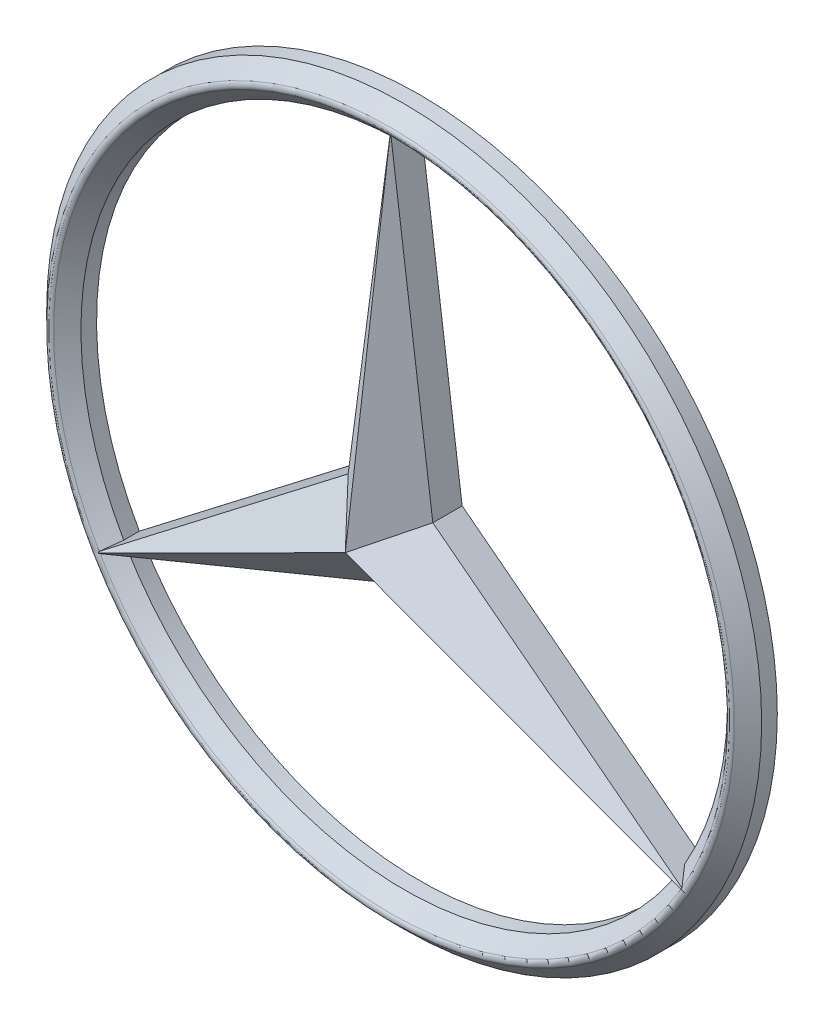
ISO-10303-21;
HEADER;
FILE_DESCRIPTION(('STEP AP214'),'2;1');
FILE_NAME('part.step','',(''),(''),'','','');
FILE_SCHEMA(('AUTOMOTIVE_DESIGN { 1 0 10303 214 1 1 1 1 }'));
ENDSEC;
DATA;
#1=APPLICATION_CONTEXT('core data for automotive mechanical design processes');
#2=APPLICATION_PROTOCOL_DEFINITION('international standard','automotive_design',2000,#1);
#3=PRODUCT_CONTEXT('',#1,'mechanical');
#4=PRODUCT('Part','Part','',(#3));
#5=PRODUCT_RELATED_PRODUCT_CATEGORY('part','',(#4));
#6=PRODUCT_DEFINITION_FORMATION('','',#4);
#7=PRODUCT_DEFINITION_CONTEXT('part definition',#1,'design');
#8=PRODUCT_DEFINITION('design','',#6,#7);
#9=PRODUCT_DEFINITION_SHAPE('','',#8);
#10=(LENGTH_UNIT() NAMED_UNIT(*) SI_UNIT(.MILLI.,.METRE.));
#11=(NAMED_UNIT(*) PLANE_ANGLE_UNIT() SI_UNIT($,.RADIAN.));
#12=(NAMED_UNIT(*) SI_UNIT($,.STERADIAN.) SOLID_ANGLE_UNIT());
#13=UNCERTAINTY_MEASURE_WITH_UNIT(LENGTH_MEASURE(1.E-05),#10,'distance_accuracy_value','');
#14=(GEOMETRIC_REPRESENTATION_CONTEXT(3) GLOBAL_UNCERTAINTY_ASSIGNED_CONTEXT((#13)) GLOBAL_UNIT_ASSIGNED_CONTEXT((#10,
#11,#12)) REPRESENTATION_CONTEXT('',''));
#15=CARTESIAN_POINT('',(0.,0.,0.));
#16=DIRECTION('',(0.,0.,1.));
#17=DIRECTION('',(1.,0.,0.));
#18=AXIS2_PLACEMENT_3D('',#15,#16,#17);
#19=CARTESIAN_POINT('',(0.,5.17159232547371,3.05312334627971));
#20=DIRECTION('',(0.,0.,1.));
#21=DIRECTION('',(0.,-1.,0.));
#22=AXIS2_PLACEMENT_3D('',#19,#20,#21);
#23=CONICAL_SURFACE('',#22,27.8472474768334,0.785398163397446);
#24=CARTESIAN_POINT('',(22.9461360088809,-7.97843726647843,1.65296334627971));
#25=CARTESIAN_POINT('',(23.0954369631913,-8.09336919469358,1.83964845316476));
#26=CARTESIAN_POINT('',(23.2447242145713,-8.20829057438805,2.0263510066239));
#27=CARTESIAN_POINT('',(23.5432713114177,-8.43811223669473,2.39979100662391));
#28=CARTESIAN_POINT('',(23.692531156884,-8.55301251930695,2.58652845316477));
#29=CARTESIAN_POINT('',(23.84177729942,-8.66790225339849,2.7732833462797));
#30=B_SPLINE_CURVE_WITH_KNOTS('',3,(#24,#25,#26,#27,#28,#29),.UNSPECIFIED.,.F.,.F.,(4,2,4),(0.,
0.795715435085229,1.59143086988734),.UNSPECIFIED.);
#31=CARTESIAN_POINT('',(22.9462639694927,-7.97853577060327,1.65312334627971));
#32=VERTEX_POINT('',#31);
#33=CARTESIAN_POINT('',(23.839377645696,-8.6660549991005,2.7702806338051));
#34=VERTEX_POINT('',#33);
#35=EDGE_CURVE('E232',#32,#34,#30,.T.);
#36=ORIENTED_EDGE('',*,*,#35,.T.);
#37=CARTESIAN_POINT('',(0.,5.17159232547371,2.7702806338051));
#38=DIRECTION('',(0.,0.,-1.));
#39=DIRECTION('',(0.,1.,0.));
#40=AXIS2_PLACEMENT_3D('',#37,#38,#39);
#41=CIRCLE('',#40,27.5644047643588);
#42=CARTESIAN_POINT('',(0.0376878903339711,32.7359713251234,2.77028063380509));
#43=VERTEX_POINT('',#42);
#44=EDGE_CURVE('E350',#34,#43,#41,.F.);
#45=ORIENTED_EDGE('',*,*,#44,.T.);
#46=CARTESIAN_POINT('',(0.0372877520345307,32.738974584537,2.7732833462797));
#47=CARTESIAN_POINT('',(0.0621745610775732,32.5521853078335,2.5865264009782));
#48=CARTESIAN_POINT('',(0.087063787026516,32.3653778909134,2.39978792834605));
#49=CARTESIAN_POINT('',(0.136847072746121,31.9917267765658,2.02634792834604));
#50=CARTESIAN_POINT('',(0.161741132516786,31.8048830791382,1.83964640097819));
#51=CARTESIAN_POINT('',(0.186637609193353,31.618021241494,1.65296334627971));
#52=B_SPLINE_CURVE_WITH_KNOTS('',3,(#46,#47,#48,#49,#50,#51),.UNSPECIFIED.,.F.,.F.,(4,2,4),(0.,
0.795920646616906,1.59184129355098),.UNSPECIFIED.);
#53=CARTESIAN_POINT('',(0.186616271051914,31.6181813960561,1.6531233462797));
#54=VERTEX_POINT('',#53);
#55=EDGE_CURVE('E283',#43,#54,#52,.T.);
#56=ORIENTED_EDGE('',*,*,#55,.T.);
#57=CARTESIAN_POINT('',(0.,5.17159232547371,1.6531233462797));
#58=DIRECTION('',(0.,0.,1.));
#59=DIRECTION('',(0.,-1.,0.));
#60=AXIS2_PLACEMENT_3D('',#57,#58,#59);
#61=CIRCLE('',#60,26.4472474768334);
#62=EDGE_CURVE('E211',#32,#54,#61,.T.);
#63=ORIENTED_EDGE('',*,*,#62,.F.);
#64=EDGE_LOOP('',(#36,#45,#56,#63));
#65=FACE_BOUND('',#64,.T.);
#66=ADVANCED_FACE('F37',(#65),#23,.F.);
#67=CARTESIAN_POINT('',(-0.186637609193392,31.618021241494,1.65296334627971));
#68=CARTESIAN_POINT('',(-0.161741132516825,31.8048830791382,1.83964640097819));
#69=CARTESIAN_POINT('',(-0.13684707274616,31.9917267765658,2.02634792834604));
#70=CARTESIAN_POINT('',(-0.0870637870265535,32.3653778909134,2.39978792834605));
#71=CARTESIAN_POINT('',(-0.0621745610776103,32.5521853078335,2.5865264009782));
#72=CARTESIAN_POINT('',(-0.0372877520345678,32.738974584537,2.7732833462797));
#73=B_SPLINE_CURVE_WITH_KNOTS('',3,(#67,#68,#69,#70,#71,#72),.UNSPECIFIED.,.F.,.F.,(4,2,4),(0.,
0.795920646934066,1.59184129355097),.UNSPECIFIED.);
#74=CARTESIAN_POINT('',(-0.186616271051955,31.6181813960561,1.6531233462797));
#75=VERTEX_POINT('',#74);
#76=CARTESIAN_POINT('',(-0.0376878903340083,32.7359713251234,2.77028063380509));
#77=VERTEX_POINT('',#76);
#78=EDGE_CURVE('E277',#75,#77,#73,.T.);
#79=ORIENTED_EDGE('',*,*,#78,.T.);
#80=CARTESIAN_POINT('',(0.,5.17159232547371,2.7702806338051));
#81=DIRECTION('',(0.,0.,-1.));
#82=DIRECTION('',(0.,1.,0.));
#83=AXIS2_PLACEMENT_3D('',#80,#81,#82);
#84=CIRCLE('',#83,27.5644047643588);
#85=CARTESIAN_POINT('',(-23.839377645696,-8.66605499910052,2.7702806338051));
#86=VERTEX_POINT('',#85);
#87=EDGE_CURVE('E353',#77,#86,#84,.F.);
#88=ORIENTED_EDGE('',*,*,#87,.T.);
#89=CARTESIAN_POINT('',(-23.84177729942,-8.6679022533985,2.7732833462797));
#90=CARTESIAN_POINT('',(-23.692531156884,-8.55301251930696,2.58652845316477));
#91=CARTESIAN_POINT('',(-23.5432713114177,-8.43811223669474,2.39979100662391));
#92=CARTESIAN_POINT('',(-23.2447242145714,-8.20829057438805,2.0263510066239));
#93=CARTESIAN_POINT('',(-23.0954369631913,-8.09336919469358,1.83964845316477));
#94=CARTESIAN_POINT('',(-22.9461360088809,-7.97843726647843,1.65296334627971));
#95=B_SPLINE_CURVE_WITH_KNOTS('',3,(#89,#90,#91,#92,#93,#94),.UNSPECIFIED.,.F.,.F.,(4,2,4),(0.,
0.795715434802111,1.59143086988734),.UNSPECIFIED.);
#96=CARTESIAN_POINT('',(-22.9462639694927,-7.97853577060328,1.65312334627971));
#97=VERTEX_POINT('',#96);
#98=EDGE_CURVE('E266',#86,#97,#95,.T.);
#99=ORIENTED_EDGE('',*,*,#98,.T.);
#100=EDGE_CURVE('E210',#75,#97,#61,.T.);
#101=ORIENTED_EDGE('',*,*,#100,.F.);
#102=EDGE_LOOP('',(#79,#88,#99,#101));
#103=FACE_BOUND('',#102,.T.);
#104=ADVANCED_FACE('F254',(#103),#23,.F.);
#105=CARTESIAN_POINT('',(-22.7270109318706,-8.35362154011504,1.65296334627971));
#106=CARTESIAN_POINT('',(-22.9014372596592,-8.42555374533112,1.83964298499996));
#107=CARTESIAN_POINT('',(-23.0758451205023,-8.49747833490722,2.02634280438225));
#108=CARTESIAN_POINT('',(-23.4246239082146,-8.64131228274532,2.39978280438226));
#109=CARTESIAN_POINT('',(-23.5989948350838,-8.71322164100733,2.58652298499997));
#110=CARTESIAN_POINT('',(-23.7733472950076,-8.78512338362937,2.7732833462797));
#111=B_SPLINE_CURVE_WITH_KNOTS('',3,(#105,#106,#107,#108,#109,#110),.UNSPECIFIED.,.F.,.F.,(4,2,
4),(0.,0.796261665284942,1.59252333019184),.UNSPECIFIED.);
#112=CARTESIAN_POINT('',(-22.7271604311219,-8.3536831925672,1.65312334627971));
#113=VERTEX_POINT('',#112);
#114=CARTESIAN_POINT('',(-23.7705440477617,-8.78396734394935,2.7702806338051));
#115=VERTEX_POINT('',#114);
#116=EDGE_CURVE('E272',#113,#115,#111,.T.);
#117=ORIENTED_EDGE('',*,*,#116,.T.);
#118=CARTESIAN_POINT('',(0.,5.17159232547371,2.7702806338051));
#119=DIRECTION('',(0.,0.,-1.));
#120=DIRECTION('',(0.,1.,0.));
#121=AXIS2_PLACEMENT_3D('',#118,#119,#120);
#122=CIRCLE('',#121,27.5644047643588);
#123=CARTESIAN_POINT('',(23.7705440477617,-8.78396734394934,2.7702806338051));
#124=VERTEX_POINT('',#123);
#125=EDGE_CURVE('E355',#115,#124,#122,.F.);
#126=ORIENTED_EDGE('',*,*,#125,.T.);
#127=CARTESIAN_POINT('',(23.7733472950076,-8.78512338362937,2.7732833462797));
#128=CARTESIAN_POINT('',(23.5989948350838,-8.71322164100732,2.58652298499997));
#129=CARTESIAN_POINT('',(23.4246239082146,-8.64131228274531,2.39978280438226));
#130=CARTESIAN_POINT('',(23.0758451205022,-8.49747833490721,2.02634280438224));
#131=CARTESIAN_POINT('',(22.9014372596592,-8.42555374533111,1.83964298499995));
#132=CARTESIAN_POINT('',(22.7270109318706,-8.35362154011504,1.65296334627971));
#133=B_SPLINE_CURVE_WITH_KNOTS('',3,(#127,#128,#129,#130,#131,#132),.UNSPECIFIED.,.F.,.F.,(4,2,
4),(0.,0.796261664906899,1.59252333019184),.UNSPECIFIED.);
#134=CARTESIAN_POINT('',(22.7271604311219,-8.35368319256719,1.65312334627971));
#135=VERTEX_POINT('',#134);
#136=EDGE_CURVE('E239',#124,#135,#133,.T.);
#137=ORIENTED_EDGE('',*,*,#136,.T.);
#138=EDGE_CURVE('E205',#113,#135,#61,.T.);
#139=ORIENTED_EDGE('',*,*,#138,.F.);
#140=EDGE_LOOP('',(#117,#126,#137,#139));
#141=FACE_BOUND('',#140,.T.);
#142=ADVANCED_FACE('F248',(#141),#23,.F.);
#143=CARTESIAN_POINT('',(0.,1.01883980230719,2.7731233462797));
#144=DIRECTION('',(-0.381246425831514,0.924473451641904,0.));
#145=DIRECTION('',(-0.924473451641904,-0.381246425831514,0.));
#146=AXIS2_PLACEMENT_3D('',#143,#144,#145);
#147=PLANE('',#146);
#148=DIRECTION('',(0.,0.,1.));
#149=VECTOR('',#148,1.);
#150=CARTESIAN_POINT('',(-22.7271604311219,-8.3536831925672,6.18858584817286));
#151=LINE('',#150,#149);
#152=CARTESIAN_POINT('',(-22.7271604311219,-8.3536831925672,0.373123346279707));
#153=VERTEX_POINT('',#152);
#154=EDGE_CURVE('E230',#153,#113,#151,.T.);
#155=ORIENTED_EDGE('',*,*,#154,.F.);
#156=DIRECTION('',(0.924473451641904,0.381246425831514,0.));
#157=VECTOR('',#156,1.);
#158=CARTESIAN_POINT('',(0.,1.01883980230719,0.373123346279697));
#159=LINE('',#158,#157);
#160=CARTESIAN_POINT('',(0.,1.01883980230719,0.373123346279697));
#161=VERTEX_POINT('',#160);
#162=EDGE_CURVE('E380',#153,#161,#159,.T.);
#163=ORIENTED_EDGE('',*,*,#162,.T.);
#164=DIRECTION('',(0.,0.,-1.));
#165=VECTOR('',#164,1.);
#166=CARTESIAN_POINT('',(0.,1.01883980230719,2.7731233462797));
#167=LINE('',#166,#165);
#168=CARTESIAN_POINT('',(0.,1.01883980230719,2.7731233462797));
#169=VERTEX_POINT('',#168);
#170=EDGE_CURVE('E357',#169,#161,#167,.T.);
#171=ORIENTED_EDGE('',*,*,#170,.F.);
#172=DIRECTION('',(0.924473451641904,0.381246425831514,0.));
#173=VECTOR('',#172,1.);
#174=CARTESIAN_POINT('',(0.,1.01883980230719,2.7731233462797));
#175=LINE('',#174,#173);
#176=CARTESIAN_POINT('',(-23.7732248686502,-8.78507289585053,2.7731233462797));
#177=VERTEX_POINT('',#176);
#178=EDGE_CURVE('E167',#177,#169,#175,.T.);
#179=ORIENTED_EDGE('',*,*,#178,.F.);
#180=CARTESIAN_POINT('',(-23.7732248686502,-8.78507289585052,2.7731233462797));
#181=CARTESIAN_POINT('',(-23.772775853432,-8.78488772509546,2.77265200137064));
#182=CARTESIAN_POINT('',(-23.7723279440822,-8.78470301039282,2.7721794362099));
#183=CARTESIAN_POINT('',(-23.7714343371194,-8.78433449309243,2.77123186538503));
#184=CARTESIAN_POINT('',(-23.7709886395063,-8.78415069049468,2.77075685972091));
#185=CARTESIAN_POINT('',(-23.7705440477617,-8.78396734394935,2.7702806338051));
#186=B_SPLINE_CURVE_WITH_KNOTS('',3,(#180,#181,#182,#183,#184,#185),.UNSPECIFIED.,.F.,.F.,(4,2,
4),(0.,0.00203040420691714,0.00406080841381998),.UNSPECIFIED.);
#187=EDGE_CURVE('E398',#177,#115,#186,.T.);
#188=ORIENTED_EDGE('',*,*,#187,.T.);
#189=ORIENTED_EDGE('',*,*,#116,.F.);
#190=EDGE_LOOP('',(#155,#163,#171,#179,#188,#189));
#191=FACE_BOUND('',#190,.T.);
#192=ADVANCED_FACE('F253',(#191),#147,.F.);
#193=CARTESIAN_POINT('',(24.2487113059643,-8.98116019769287,2.7731233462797));
#194=DIRECTION('',(0.381246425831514,0.924473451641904,0.));
#195=DIRECTION('',(-0.924473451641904,0.381246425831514,0.));
#196=AXIS2_PLACEMENT_3D('',#193,#194,#195);
#197=PLANE('',#196);
#198=DIRECTION('',(0.,0.,1.));
#199=VECTOR('',#198,1.);
#200=CARTESIAN_POINT('',(22.7271604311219,-8.35368319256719,6.18858584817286));
#201=LINE('',#200,#199);
#202=CARTESIAN_POINT('',(22.7271604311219,-8.35368319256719,0.373123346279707));
#203=VERTEX_POINT('',#202);
#204=EDGE_CURVE('E228',#135,#203,#201,.F.);
#205=ORIENTED_EDGE('',*,*,#204,.F.);
#206=ORIENTED_EDGE('',*,*,#136,.F.);
#207=CARTESIAN_POINT('',(23.7705440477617,-8.78396734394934,2.7702806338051));
#208=CARTESIAN_POINT('',(23.7709886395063,-8.78415069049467,2.77075685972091));
#209=CARTESIAN_POINT('',(23.7714343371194,-8.78433449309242,2.77123186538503));
#210=CARTESIAN_POINT('',(23.7723279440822,-8.78470301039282,2.7721794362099));
#211=CARTESIAN_POINT('',(23.772775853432,-8.78488772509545,2.77265200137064));
#212=CARTESIAN_POINT('',(23.7732248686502,-8.78507289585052,2.77312334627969));
#213=B_SPLINE_CURVE_WITH_KNOTS('',3,(#207,#208,#209,#210,#211,#212),.UNSPECIFIED.,.F.,.F.,(4,2,
4),(0.,0.0020304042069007,0.00406080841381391),.UNSPECIFIED.);
#214=CARTESIAN_POINT('',(23.7732248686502,-8.78507289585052,2.7731233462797));
#215=VERTEX_POINT('',#214);
#216=EDGE_CURVE('E393',#124,#215,#213,.T.);
#217=ORIENTED_EDGE('',*,*,#216,.T.);
#218=DIRECTION('',(0.924473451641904,-0.381246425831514,0.));
#219=VECTOR('',#218,1.);
#220=CARTESIAN_POINT('',(24.2487113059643,-8.98116019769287,2.7731233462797));
#221=LINE('',#220,#219);
#222=EDGE_CURVE('E387',#169,#215,#221,.T.);
#223=ORIENTED_EDGE('',*,*,#222,.F.);
#224=ORIENTED_EDGE('',*,*,#170,.T.);
#225=DIRECTION('',(0.924473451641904,-0.381246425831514,0.));
#226=VECTOR('',#225,1.);
#227=CARTESIAN_POINT('',(24.2487113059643,-8.98116019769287,0.373123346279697));
#228=LINE('',#227,#226);
#229=EDGE_CURVE('E377',#161,#203,#228,.T.);
#230=ORIENTED_EDGE('',*,*,#229,.T.);
#231=EDGE_LOOP('',(#205,#206,#217,#223,#224,#230));
#232=FACE_BOUND('',#231,.T.);
#233=ADVANCED_FACE('F395',(#232),#197,.F.);
#234=CARTESIAN_POINT('',(3.46410161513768,7.01883980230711,2.7731233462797));
#235=DIRECTION('',(-0.609994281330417,-0.792405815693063,0.));
#236=DIRECTION('',(0.792405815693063,-0.609994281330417,0.));
#237=AXIS2_PLACEMENT_3D('',#234,#235,#236);
#238=PLANE('',#237);
#239=DIRECTION('',(0.,0.,1.));
#240=VECTOR('',#239,1.);
#241=CARTESIAN_POINT('',(22.9462639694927,-7.97853577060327,6.18858584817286));
#242=LINE('',#241,#240);
#243=CARTESIAN_POINT('',(22.9462639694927,-7.97853577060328,0.373123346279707));
#244=VERTEX_POINT('',#243);
#245=EDGE_CURVE('E226',#244,#32,#242,.T.);
#246=ORIENTED_EDGE('',*,*,#245,.F.);
#247=DIRECTION('',(-0.792405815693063,0.609994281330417,0.));
#248=VECTOR('',#247,1.);
#249=CARTESIAN_POINT('',(3.46410161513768,7.01883980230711,0.373123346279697));
#250=LINE('',#249,#248);
#251=CARTESIAN_POINT('',(3.46410161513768,7.01883980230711,0.373123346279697));
#252=VERTEX_POINT('',#251);
#253=EDGE_CURVE('E375',#244,#252,#250,.T.);
#254=ORIENTED_EDGE('',*,*,#253,.T.);
#255=DIRECTION('',(0.,0.,-1.));
#256=VECTOR('',#255,1.);
#257=CARTESIAN_POINT('',(3.46410161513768,7.01883980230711,2.7731233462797));
#258=LINE('',#257,#256);
#259=CARTESIAN_POINT('',(3.46410161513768,7.01883980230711,2.7731233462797));
#260=VERTEX_POINT('',#259);
#261=EDGE_CURVE('E360',#260,#252,#258,.T.);
#262=ORIENTED_EDGE('',*,*,#261,.F.);
#263=DIRECTION('',(-0.792405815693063,0.609994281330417,0.));
#264=VECTOR('',#263,1.);
#265=CARTESIAN_POINT('',(3.46410161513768,7.01883980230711,2.7731233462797));
#266=LINE('',#265,#264);
#267=CARTESIAN_POINT('',(23.8416724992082,-8.66782157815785,2.7731233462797));
#268=VERTEX_POINT('',#267);
#269=EDGE_CURVE('E56',#268,#260,#266,.T.);
#270=ORIENTED_EDGE('',*,*,#269,.F.);
#271=CARTESIAN_POINT('',(23.8416724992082,-8.66782157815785,2.7731233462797));
#272=CARTESIAN_POINT('',(23.8412881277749,-8.66752568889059,2.77265199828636));
#273=CARTESIAN_POINT('',(23.8409047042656,-8.66723052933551,2.77217943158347));
#274=CARTESIAN_POINT('',(23.8401397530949,-8.66664166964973,2.77123186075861));
#275=CARTESIAN_POINT('',(23.8397582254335,-8.66634796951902,2.77075685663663));
#276=CARTESIAN_POINT('',(23.839377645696,-8.6660549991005,2.7702806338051));
#277=B_SPLINE_CURVE_WITH_KNOTS('',3,(#271,#272,#273,#274,#275,#276),.UNSPECIFIED.,.F.,.F.,(4,2,
4),(0.,0.00202905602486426,0.00405811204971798),.UNSPECIFIED.);
#278=EDGE_CURVE('E11',#268,#34,#277,.T.);
#279=ORIENTED_EDGE('',*,*,#278,.T.);
#280=ORIENTED_EDGE('',*,*,#35,.F.);
#281=EDGE_LOOP('',(#246,#254,#262,#270,#279,#280));
#282=FACE_BOUND('',#281,.T.);
#283=ADVANCED_FACE('F245',(#282),#238,.F.);
#284=CARTESIAN_POINT('',(0.,33.0188398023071,2.7731233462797));
#285=DIRECTION('',(-0.99124070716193,-0.132067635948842,0.));
#286=DIRECTION('',(0.132067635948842,-0.991240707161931,0.));
#287=AXIS2_PLACEMENT_3D('',#284,#285,#286);
#288=PLANE('',#287);
#289=DIRECTION('',(0.,0.,1.));
#290=VECTOR('',#289,1.);
#291=CARTESIAN_POINT('',(0.186616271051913,31.6181813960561,6.18858584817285));
#292=LINE('',#291,#290);
#293=CARTESIAN_POINT('',(0.186616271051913,31.6181813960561,0.373123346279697));
#294=VERTEX_POINT('',#293);
#295=EDGE_CURVE('E224',#54,#294,#292,.F.);
#296=ORIENTED_EDGE('',*,*,#295,.F.);
#297=ORIENTED_EDGE('',*,*,#55,.F.);
#298=CARTESIAN_POINT('',(0.0376878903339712,32.7359713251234,2.77028063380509));
#299=CARTESIAN_POINT('',(0.0376244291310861,32.7364476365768,2.77075685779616));
#300=CARTESIAN_POINT('',(0.0375608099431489,32.7369251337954,2.77123186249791));
#301=CARTESIAN_POINT('',(0.0374332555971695,32.7378824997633,2.77217943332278));
#302=CARTESIAN_POINT('',(0.0373693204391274,32.7383623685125,2.7726519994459));
#303=CARTESIAN_POINT('',(0.0373052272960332,32.7388434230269,2.7731233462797));
#304=B_SPLINE_CURVE_WITH_KNOTS('',3,(#298,#299,#300,#301,#302,#303),.UNSPECIFIED.,.F.,.F.,(4,2,
4),(0.,0.00202956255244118,0.0040591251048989),.UNSPECIFIED.);
#305=CARTESIAN_POINT('',(0.0373052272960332,32.7388434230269,2.7731233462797));
#306=VERTEX_POINT('',#305);
#307=EDGE_CURVE('E341',#43,#306,#304,.T.);
#308=ORIENTED_EDGE('',*,*,#307,.T.);
#309=DIRECTION('',(-0.132067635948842,0.991240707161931,0.));
#310=VECTOR('',#309,1.);
#311=CARTESIAN_POINT('',(0.,33.0188398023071,2.7731233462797));
#312=LINE('',#311,#310);
#313=EDGE_CURVE('E384',#260,#306,#312,.T.);
#314=ORIENTED_EDGE('',*,*,#313,.F.);
#315=ORIENTED_EDGE('',*,*,#261,.T.);
#316=DIRECTION('',(-0.132067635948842,0.991240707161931,0.));
#317=VECTOR('',#316,1.);
#318=CARTESIAN_POINT('',(0.,33.0188398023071,0.373123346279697));
#319=LINE('',#318,#317);
#320=EDGE_CURVE('E372',#252,#294,#319,.T.);
#321=ORIENTED_EDGE('',*,*,#320,.T.);
#322=EDGE_LOOP('',(#296,#297,#308,#314,#315,#321));
#323=FACE_BOUND('',#322,.T.);
#324=ADVANCED_FACE('F292',(#323),#288,.F.);
#325=CARTESIAN_POINT('',(-3.46410161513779,7.01883980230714,2.7731233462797));
#326=DIRECTION('',(0.99124070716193,-0.132067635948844,0.));
#327=DIRECTION('',(0.132067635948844,0.99124070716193,0.));
#328=AXIS2_PLACEMENT_3D('',#325,#326,#327);
#329=PLANE('',#328);
#330=DIRECTION('',(0.,0.,1.));
#331=VECTOR('',#330,1.);
#332=CARTESIAN_POINT('',(-0.186616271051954,31.6181813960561,6.18858584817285));
#333=LINE('',#332,#331);
#334=CARTESIAN_POINT('',(-0.186616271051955,31.6181813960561,0.373123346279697));
#335=VERTEX_POINT('',#334);
#336=EDGE_CURVE('E222',#335,#75,#333,.T.);
#337=ORIENTED_EDGE('',*,*,#336,.F.);
#338=DIRECTION('',(-0.132067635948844,-0.99124070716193,0.));
#339=VECTOR('',#338,1.);
#340=CARTESIAN_POINT('',(-3.46410161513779,7.01883980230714,0.373123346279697));
#341=LINE('',#340,#339);
#342=CARTESIAN_POINT('',(-3.46410161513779,7.01883980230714,0.373123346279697));
#343=VERTEX_POINT('',#342);
#344=EDGE_CURVE('E370',#335,#343,#341,.T.);
#345=ORIENTED_EDGE('',*,*,#344,.T.);
#346=DIRECTION('',(0.,0.,-1.));
#347=VECTOR('',#346,1.);
#348=CARTESIAN_POINT('',(-3.46410161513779,7.01883980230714,2.7731233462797));
#349=LINE('',#348,#347);
#350=CARTESIAN_POINT('',(-3.46410161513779,7.01883980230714,2.7731233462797));
#351=VERTEX_POINT('',#350);
#352=EDGE_CURVE('E363',#351,#343,#349,.T.);
#353=ORIENTED_EDGE('',*,*,#352,.F.);
#354=DIRECTION('',(-0.132067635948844,-0.99124070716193,0.));
#355=VECTOR('',#354,1.);
#356=CARTESIAN_POINT('',(-3.46410161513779,7.01883980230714,2.7731233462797));
#357=LINE('',#356,#355);
#358=CARTESIAN_POINT('',(-0.0373052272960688,32.7388434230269,2.7731233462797));
#359=VERTEX_POINT('',#358);
#360=EDGE_CURVE('E195',#359,#351,#357,.T.);
#361=ORIENTED_EDGE('',*,*,#360,.F.);
#362=CARTESIAN_POINT('',(-0.0373052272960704,32.7388434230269,2.7731233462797));
#363=CARTESIAN_POINT('',(-0.0373693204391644,32.7383623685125,2.7726519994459));
#364=CARTESIAN_POINT('',(-0.0374332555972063,32.7378824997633,2.77217943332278));
#365=CARTESIAN_POINT('',(-0.037560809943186,32.7369251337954,2.77123186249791));
#366=CARTESIAN_POINT('',(-0.0376244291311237,32.7364476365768,2.77075685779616));
#367=CARTESIAN_POINT('',(-0.0376878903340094,32.7359713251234,2.77028063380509));
#368=B_SPLINE_CURVE_WITH_KNOTS('',3,(#362,#363,#364,#365,#366,#367),.UNSPECIFIED.,.F.,.F.,(4,2,
4),(0.,0.00202956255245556,0.00405912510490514),.UNSPECIFIED.);
#369=EDGE_CURVE('E299',#359,#77,#368,.T.);
#370=ORIENTED_EDGE('',*,*,#369,.T.);
#371=ORIENTED_EDGE('',*,*,#78,.F.);
#372=EDGE_LOOP('',(#337,#345,#353,#361,#370,#371));
#373=FACE_BOUND('',#372,.T.);
#374=ADVANCED_FACE('F288',(#373),#329,.F.);
#375=CARTESIAN_POINT('',(-24.2487113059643,-8.98116019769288,2.7731233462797));
#376=DIRECTION('',(0.60999428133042,-0.792405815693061,0.));
#377=DIRECTION('',(0.792405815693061,0.60999428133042,0.));
#378=AXIS2_PLACEMENT_3D('',#375,#376,#377);
#379=PLANE('',#378);
#380=DIRECTION('',(0.,0.,1.));
#381=VECTOR('',#380,1.);
#382=CARTESIAN_POINT('',(-22.9462639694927,-7.97853577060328,6.18858584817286));
#383=LINE('',#382,#381);
#384=CARTESIAN_POINT('',(-22.9462639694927,-7.97853577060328,0.373123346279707));
#385=VERTEX_POINT('',#384);
#386=EDGE_CURVE('E220',#97,#385,#383,.F.);
#387=ORIENTED_EDGE('',*,*,#386,.F.);
#388=ORIENTED_EDGE('',*,*,#98,.F.);
#389=CARTESIAN_POINT('',(-23.839377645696,-8.66605499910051,2.7702806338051));
#390=CARTESIAN_POINT('',(-23.8397582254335,-8.66634796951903,2.77075685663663));
#391=CARTESIAN_POINT('',(-23.8401397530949,-8.66664166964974,2.77123186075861));
#392=CARTESIAN_POINT('',(-23.8409047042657,-8.66723052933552,2.77217943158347));
#393=CARTESIAN_POINT('',(-23.8412881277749,-8.6675256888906,2.77265199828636));
#394=CARTESIAN_POINT('',(-23.8416724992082,-8.66782157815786,2.7731233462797));
#395=B_SPLINE_CURVE_WITH_KNOTS('',3,(#389,#390,#391,#392,#393,#394),.UNSPECIFIED.,.F.,.F.,(4,2,
4),(0.,0.00202905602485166,0.00405811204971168),.UNSPECIFIED.);
#396=CARTESIAN_POINT('',(-23.8416724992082,-8.66782157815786,2.7731233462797));
#397=VERTEX_POINT('',#396);
#398=EDGE_CURVE('E305',#86,#397,#395,.T.);
#399=ORIENTED_EDGE('',*,*,#398,.T.);
#400=DIRECTION('',(-0.792405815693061,-0.60999428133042,0.));
#401=VECTOR('',#400,1.);
#402=CARTESIAN_POINT('',(-24.2487113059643,-8.98116019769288,2.7731233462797));
#403=LINE('',#402,#401);
#404=EDGE_CURVE('E366',#351,#397,#403,.T.);
#405=ORIENTED_EDGE('',*,*,#404,.F.);
#406=ORIENTED_EDGE('',*,*,#352,.T.);
#407=DIRECTION('',(-0.792405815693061,-0.60999428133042,0.));
#408=VECTOR('',#407,1.);
#409=CARTESIAN_POINT('',(-24.2487113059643,-8.98116019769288,0.373123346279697));
#410=LINE('',#409,#408);
#411=EDGE_CURVE('E367',#343,#385,#410,.T.);
#412=ORIENTED_EDGE('',*,*,#411,.T.);
#413=EDGE_LOOP('',(#387,#388,#399,#405,#406,#412));
#414=FACE_BOUND('',#413,.T.);
#415=ADVANCED_FACE('F291',(#414),#379,.F.);
#416=CARTESIAN_POINT('',(0.,1.01883980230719,0.373123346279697));
#417=DIRECTION('',(0.,0.,1.));
#418=DIRECTION('',(1.,0.,0.));
#419=AXIS2_PLACEMENT_3D('',#416,#417,#418);
#420=PLANE('',#419);
#421=ORIENTED_EDGE('',*,*,#162,.F.);
#422=CARTESIAN_POINT('',(0.,5.17159232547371,0.373123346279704));
#423=DIRECTION('',(0.,0.,1.));
#424=DIRECTION('',(0.,-1.,0.));
#425=AXIS2_PLACEMENT_3D('',#422,#423,#424);
#426=CIRCLE('',#425,26.4472474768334);
#427=EDGE_CURVE('E212',#153,#203,#426,.T.);
#428=ORIENTED_EDGE('',*,*,#427,.T.);
#429=ORIENTED_EDGE('',*,*,#229,.F.);
#430=EDGE_LOOP('',(#421,#428,#429));
#431=FACE_BOUND('',#430,.T.);
#432=ORIENTED_EDGE('',*,*,#253,.F.);
#433=EDGE_CURVE('E216',#244,#294,#426,.T.);
#434=ORIENTED_EDGE('',*,*,#433,.T.);
#435=ORIENTED_EDGE('',*,*,#320,.F.);
#436=EDGE_LOOP('',(#432,#434,#435));
#437=FACE_BOUND('',#436,.T.);
#438=ORIENTED_EDGE('',*,*,#344,.F.);
#439=EDGE_CURVE('E215',#335,#385,#426,.T.);
#440=ORIENTED_EDGE('',*,*,#439,.T.);
#441=ORIENTED_EDGE('',*,*,#411,.F.);
#442=EDGE_LOOP('',(#438,#440,#441));
#443=FACE_BOUND('',#442,.T.);
#444=CARTESIAN_POINT('',(0.,5.17159232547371,0.373123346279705));
#445=DIRECTION('',(0.,0.,1.));
#446=DIRECTION('',(0.,-1.,0.));
#447=AXIS2_PLACEMENT_3D('',#444,#445,#446);
#448=CIRCLE('',#447,29.2472474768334);
#449=CARTESIAN_POINT('',(0.,-24.0756551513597,0.373123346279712));
#450=VERTEX_POINT('',#449);
#451=EDGE_CURVE('E217',#450,#450,#448,.T.);
#452=ORIENTED_EDGE('',*,*,#451,.F.);
#453=EDGE_LOOP('',(#452));
#454=FACE_BOUND('',#453,.T.);
#455=ADVANCED_FACE('F450',(#431,#437,#443,#454),#420,.F.);
#456=CARTESIAN_POINT('',(0.,5.17159232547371,6.18858584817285));
#457=DIRECTION('',(0.,0.,1.));
#458=DIRECTION('',(0.,-1.,0.));
#459=AXIS2_PLACEMENT_3D('',#456,#457,#458);
#460=CYLINDRICAL_SURFACE('',#459,26.4472474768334);
#461=ORIENTED_EDGE('',*,*,#427,.F.);
#462=ORIENTED_EDGE('',*,*,#154,.T.);
#463=ORIENTED_EDGE('',*,*,#138,.T.);
#464=ORIENTED_EDGE('',*,*,#204,.T.);
#465=EDGE_LOOP('',(#461,#462,#463,#464));
#466=FACE_BOUND('',#465,.T.);
#467=ADVANCED_FACE('F258',(#466),#460,.F.);
#468=ORIENTED_EDGE('',*,*,#433,.F.);
#469=ORIENTED_EDGE('',*,*,#245,.T.);
#470=ORIENTED_EDGE('',*,*,#62,.T.);
#471=ORIENTED_EDGE('',*,*,#295,.T.);
#472=EDGE_LOOP('',(#468,#469,#470,#471));
#473=FACE_BOUND('',#472,.T.);
#474=ADVANCED_FACE('F433',(#473),#460,.F.);
#475=ORIENTED_EDGE('',*,*,#439,.F.);
#476=ORIENTED_EDGE('',*,*,#336,.T.);
#477=ORIENTED_EDGE('',*,*,#100,.T.);
#478=ORIENTED_EDGE('',*,*,#386,.T.);
#479=EDGE_LOOP('',(#475,#476,#477,#478));
#480=FACE_BOUND('',#479,.T.);
#481=ADVANCED_FACE('F439',(#480),#460,.F.);
#482=CARTESIAN_POINT('',(0.,5.17159232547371,6.18858584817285));
#483=DIRECTION('',(0.,0.,1.));
#484=DIRECTION('',(0.,-1.,0.));
#485=AXIS2_PLACEMENT_3D('',#482,#483,#484);
#486=CYLINDRICAL_SURFACE('',#485,29.2472474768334);
#487=CARTESIAN_POINT('',(0.,5.17159232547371,1.65312334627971));
#488=DIRECTION('',(0.,0.,1.));
#489=DIRECTION('',(0.,-1.,0.));
#490=AXIS2_PLACEMENT_3D('',#487,#488,#489);
#491=CIRCLE('',#490,29.2472474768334);
#492=CARTESIAN_POINT('',(0.,-24.0756551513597,1.65312334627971));
#493=VERTEX_POINT('',#492);
#494=EDGE_CURVE('E202',#493,#493,#491,.T.);
#495=ORIENTED_EDGE('',*,*,#494,.F.);
#496=EDGE_LOOP('',(#495));
#497=FACE_BOUND('',#496,.T.);
#498=ORIENTED_EDGE('',*,*,#451,.T.);
#499=EDGE_LOOP('',(#498));
#500=FACE_BOUND('',#499,.T.);
#501=ADVANCED_FACE('F488',(#497,#500),#486,.T.);
#502=CARTESIAN_POINT('',(0.,5.17159232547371,1.65312334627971));
#503=DIRECTION('',(0.,0.,-1.));
#504=DIRECTION('',(0.,1.,0.));
#505=AXIS2_PLACEMENT_3D('',#502,#503,#504);
#506=CONICAL_SURFACE('',#505,29.2472474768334,0.785398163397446);
#507=CARTESIAN_POINT('',(0.,5.17159232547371,2.7702806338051));
#508=DIRECTION('',(0.,0.,1.));
#509=DIRECTION('',(0.,-1.,0.));
#510=AXIS2_PLACEMENT_3D('',#507,#508,#509);
#511=CIRCLE('',#510,28.130090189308);
#512=CARTESIAN_POINT('',(0.,-22.9584978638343,2.7702806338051));
#513=VERTEX_POINT('',#512);
#514=EDGE_CURVE('E347',#513,#513,#511,.F.);
#515=ORIENTED_EDGE('',*,*,#514,.T.);
#516=EDGE_LOOP('',(#515));
#517=FACE_BOUND('',#516,.T.);
#518=ORIENTED_EDGE('',*,*,#494,.T.);
#519=EDGE_LOOP('',(#518));
#520=FACE_BOUND('',#519,.T.);
#521=ADVANCED_FACE('F256',(#517,#520),#506,.T.);
#522=CARTESIAN_POINT('',(-3.46410161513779,7.01883980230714,2.7731233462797));
#523=DIRECTION('',(-0.431331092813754,0.56031552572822,0.707106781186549));
#524=DIRECTION('',(0.,-0.783763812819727,0.621059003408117));
#525=AXIS2_PLACEMENT_3D('',#522,#523,#524);
#526=PLANE('',#525);
#527=ORIENTED_EDGE('',*,*,#404,.T.);
#528=CARTESIAN_POINT('',(-23.8416724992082,-8.66782157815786,2.7731233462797));
#529=CARTESIAN_POINT('',(-23.8433091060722,-8.67576029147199,2.77841570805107));
#530=CARTESIAN_POINT('',(-23.8451556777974,-8.68372775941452,2.78360277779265));
#531=CARTESIAN_POINT('',(-23.8492827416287,-8.69967587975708,2.79372267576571));
#532=CARTESIAN_POINT('',(-23.8515619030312,-8.70765641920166,2.79865622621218));
#533=CARTESIAN_POINT('',(-23.8565780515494,-8.72363545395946,2.80825828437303));
#534=CARTESIAN_POINT('',(-23.8593150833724,-8.73163395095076,2.81292676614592));
#535=CARTESIAN_POINT('',(-23.8652767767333,-8.74764584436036,2.82197808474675));
#536=CARTESIAN_POINT('',(-23.8685028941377,-8.75565921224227,2.82636001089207));
#537=CARTESIAN_POINT('',(-23.8719803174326,-8.76365446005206,2.83057428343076));
#538=B_SPLINE_CURVE_WITH_KNOTS('',3,(#528,#529,#530,#531,#532,#533,#534,#535,#536,#537),
.UNSPECIFIED.,.F.,.F.,(4,2,2,2,4),(0.,0.0290405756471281,0.0579932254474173,0.0869487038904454,
0.115992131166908),.UNSPECIFIED.);
#539=CARTESIAN_POINT('',(-23.8719803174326,-8.76365446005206,2.83057428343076));
#540=VERTEX_POINT('',#539);
#541=EDGE_CURVE('E200',#397,#540,#538,.T.);
#542=ORIENTED_EDGE('',*,*,#541,.T.);
#543=DIRECTION('',(-0.85857024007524,-0.495695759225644,-0.130930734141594));
#544=VECTOR('',#543,1.);
#545=CARTESIAN_POINT('',(-24.2487113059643,-8.98116019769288,2.7731233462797));
#546=LINE('',#545,#544);
#547=CARTESIAN_POINT('',(0.,5.01883980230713,6.47101715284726));
#548=VERTEX_POINT('',#547);
#549=EDGE_CURVE('E165',#548,#540,#546,.T.);
#550=ORIENTED_EDGE('',*,*,#549,.F.);
#551=DIRECTION('',(-0.635915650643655,0.367146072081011,-0.678833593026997));
#552=VECTOR('',#551,1.);
#553=CARTESIAN_POINT('',(-8.13358028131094,9.71476456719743,-2.21149839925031));
#554=LINE('',#553,#552);
#555=EDGE_CURVE('E190',#548,#351,#554,.T.);
#556=ORIENTED_EDGE('',*,*,#555,.T.);
#557=EDGE_LOOP('',(#527,#542,#550,#556));
#558=FACE_BOUND('',#557,.T.);
#559=ADVANCED_FACE('F198',(#558),#526,.T.);
#560=CARTESIAN_POINT('',(-24.2487113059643,-8.98116019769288,2.7731233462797));
#561=DIRECTION('',(0.269581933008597,-0.653701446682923,0.707106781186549));
#562=DIRECTION('',(0.,-0.734292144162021,-0.678833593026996));
#563=AXIS2_PLACEMENT_3D('',#560,#561,#562);
#564=PLANE('',#563);
#565=ORIENTED_EDGE('',*,*,#549,.T.);
#566=CARTESIAN_POINT('',(-23.8719803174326,-8.76365446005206,2.83057428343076));
#567=CARTESIAN_POINT('',(-23.8632719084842,-8.76462137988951,2.82636034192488));
#568=CARTESIAN_POINT('',(-23.8546722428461,-8.76581438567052,2.82197884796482));
#569=CARTESIAN_POINT('',(-23.8377283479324,-8.76861692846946,2.81292817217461));
#570=CARTESIAN_POINT('',(-23.8293834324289,-8.77022521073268,2.80825988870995));
#571=CARTESIAN_POINT('',(-23.8129356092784,-8.77382864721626,2.79865793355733));
#572=CARTESIAN_POINT('',(-23.8048326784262,-8.77582376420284,2.79372428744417));
#573=CARTESIAN_POINT('',(-23.7888513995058,-8.78018038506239,2.78360390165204));
#574=CARTESIAN_POINT('',(-23.7809737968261,-8.78254296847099,2.77841644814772));
#575=CARTESIAN_POINT('',(-23.7732248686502,-8.7850728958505,2.77312334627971));
#576=B_SPLINE_CURVE_WITH_KNOTS('',3,(#566,#567,#568,#569,#570,#571,#572,#573,#574,#575),
.UNSPECIFIED.,.F.,.F.,(4,2,2,2,4),(0.,0.0291597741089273,0.0582324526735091,0.0873023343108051,
0.116459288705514),.UNSPECIFIED.);
#577=EDGE_CURVE('E322',#540,#177,#576,.T.);
#578=ORIENTED_EDGE('',*,*,#577,.T.);
#579=ORIENTED_EDGE('',*,*,#178,.T.);
#580=DIRECTION('',(0.,-0.734292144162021,-0.678833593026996));
#581=VECTOR('',#580,1.);
#582=CARTESIAN_POINT('',(0.,-4.37300972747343,-2.21149839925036));
#583=LINE('',#582,#581);
#584=EDGE_CURVE('E161',#548,#169,#583,.T.);
#585=ORIENTED_EDGE('',*,*,#584,.F.);
#586=EDGE_LOOP('',(#565,#578,#579,#585));
#587=FACE_BOUND('',#586,.T.);
#588=ADVANCED_FACE('F162',(#587),#564,.T.);
#589=CARTESIAN_POINT('',(0.,1.01883980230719,2.7731233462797));
#590=DIRECTION('',(-0.269581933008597,-0.653701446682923,0.707106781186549));
#591=DIRECTION('',(0.,-0.734292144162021,-0.678833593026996));
#592=AXIS2_PLACEMENT_3D('',#589,#590,#591);
#593=PLANE('',#592);
#594=ORIENTED_EDGE('',*,*,#222,.T.);
#595=CARTESIAN_POINT('',(23.7732248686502,-8.78507289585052,2.7731233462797));
#596=CARTESIAN_POINT('',(23.780973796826,-8.782542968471,2.77841644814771));
#597=CARTESIAN_POINT('',(23.7888513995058,-8.78018038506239,2.78360390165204));
#598=CARTESIAN_POINT('',(23.8048326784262,-8.77582376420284,2.79372428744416));
#599=CARTESIAN_POINT('',(23.8129356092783,-8.77382864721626,2.79865793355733));
#600=CARTESIAN_POINT('',(23.8293834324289,-8.77022521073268,2.80825988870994));
#601=CARTESIAN_POINT('',(23.8377283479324,-8.76861692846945,2.8129281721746));
#602=CARTESIAN_POINT('',(23.8546722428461,-8.76581438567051,2.82197884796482));
#603=CARTESIAN_POINT('',(23.8632719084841,-8.7646213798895,2.82636034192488));
#604=CARTESIAN_POINT('',(23.8719803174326,-8.76365446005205,2.83057428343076));
#605=B_SPLINE_CURVE_WITH_KNOTS('',3,(#595,#596,#597,#598,#599,#600,#601,#602,#603,#604),
.UNSPECIFIED.,.F.,.F.,(4,2,2,2,4),(0.,0.0291569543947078,0.0582268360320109,0.0872995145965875,
0.116459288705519),.UNSPECIFIED.);
#606=CARTESIAN_POINT('',(23.8719803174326,-8.76365446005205,2.83057428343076));
#607=VERTEX_POINT('',#606);
#608=EDGE_CURVE('E172',#215,#607,#605,.T.);
#609=ORIENTED_EDGE('',*,*,#608,.T.);
#610=DIRECTION('',(0.858570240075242,-0.495695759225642,-0.130930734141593));
#611=VECTOR('',#610,1.);
#612=CARTESIAN_POINT('',(24.2487113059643,-8.98116019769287,2.7731233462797));
#613=LINE('',#612,#611);
#614=EDGE_CURVE('E63',#548,#607,#613,.T.);
#615=ORIENTED_EDGE('',*,*,#614,.F.);
#616=ORIENTED_EDGE('',*,*,#584,.T.);
#617=EDGE_LOOP('',(#594,#609,#615,#616));
#618=FACE_BOUND('',#617,.T.);
#619=ADVANCED_FACE('F170',(#618),#593,.T.);
#620=CARTESIAN_POINT('',(24.2487113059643,-8.98116019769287,2.7731233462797));
#621=DIRECTION('',(0.431331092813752,0.560315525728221,0.707106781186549));
#622=DIRECTION('',(0.,-0.783763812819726,0.621059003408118));
#623=AXIS2_PLACEMENT_3D('',#620,#621,#622);
#624=PLANE('',#623);
#625=ORIENTED_EDGE('',*,*,#614,.T.);
#626=CARTESIAN_POINT('',(23.8719803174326,-8.76365446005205,2.83057428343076));
#627=CARTESIAN_POINT('',(23.8685028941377,-8.75565921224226,2.82636001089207));
#628=CARTESIAN_POINT('',(23.8652767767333,-8.74764584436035,2.82197808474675));
#629=CARTESIAN_POINT('',(23.8593150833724,-8.73163395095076,2.81292676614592));
#630=CARTESIAN_POINT('',(23.8565780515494,-8.72363545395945,2.80825828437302));
#631=CARTESIAN_POINT('',(23.8515619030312,-8.70765641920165,2.79865622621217));
#632=CARTESIAN_POINT('',(23.8492827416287,-8.69967587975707,2.79372267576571));
#633=CARTESIAN_POINT('',(23.8451556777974,-8.68372775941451,2.78360277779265));
#634=CARTESIAN_POINT('',(23.8433091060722,-8.67576029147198,2.77841570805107));
#635=CARTESIAN_POINT('',(23.8416724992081,-8.66782157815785,2.77312334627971));
#636=B_SPLINE_CURVE_WITH_KNOTS('',3,(#626,#627,#628,#629,#630,#631,#632,#633,#634,#635),
.UNSPECIFIED.,.F.,.F.,(4,2,2,2,4),(0.,0.0290434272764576,0.0579989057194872,0.0869515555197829,
0.115992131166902),.UNSPECIFIED.);
#637=EDGE_CURVE('E50',#607,#268,#636,.T.);
#638=ORIENTED_EDGE('',*,*,#637,.T.);
#639=ORIENTED_EDGE('',*,*,#269,.T.);
#640=DIRECTION('',(0.635915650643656,0.367146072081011,-0.678833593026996));
#641=VECTOR('',#640,1.);
#642=CARTESIAN_POINT('',(8.13358028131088,9.71476456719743,-2.21149839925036));
#643=LINE('',#642,#641);
#644=EDGE_CURVE('E174',#548,#260,#643,.T.);
#645=ORIENTED_EDGE('',*,*,#644,.F.);
#646=EDGE_LOOP('',(#625,#638,#639,#645));
#647=FACE_BOUND('',#646,.T.);
#648=ADVANCED_FACE('F178',(#647),#624,.T.);
#649=CARTESIAN_POINT('',(3.46410161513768,7.01883980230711,2.7731233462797));
#650=DIRECTION('',(0.700913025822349,0.093385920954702,0.707106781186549));
#651=DIRECTION('',(0.710210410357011,0.,-0.703989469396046));
#652=AXIS2_PLACEMENT_3D('',#649,#650,#651);
#653=PLANE('',#652);
#654=ORIENTED_EDGE('',*,*,#313,.T.);
#655=CARTESIAN_POINT('',(0.0373052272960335,32.7388434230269,2.7731233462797));
#656=CARTESIAN_POINT('',(0.0308748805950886,32.7445705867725,2.77874099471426));
#657=CARTESIAN_POINT('',(0.0245509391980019,32.7505218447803,2.78422357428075));
#658=CARTESIAN_POINT('',(0.0121158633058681,32.7628725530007,2.79491859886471));
#659=CARTESIAN_POINT('',(0.00600472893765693,32.7692720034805,2.80013104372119));
#660=CARTESIAN_POINT('',(1.39945598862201E-13,32.7758955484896,2.80520841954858));
#661=B_SPLINE_CURVE_WITH_KNOTS('',3,(#655,#656,#657,#658,#659,#660),.UNSPECIFIED.,.F.,.F.,(4,2,
4),(0.,0.0308093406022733,0.0616186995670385),.UNSPECIFIED.);
#662=CARTESIAN_POINT('',(0.,32.7758955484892,2.80520841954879));
#663=VERTEX_POINT('',#662);
#664=EDGE_CURVE('E186',#306,#663,#661,.T.);
#665=ORIENTED_EDGE('',*,*,#664,.T.);
#666=DIRECTION('',(0.,0.991391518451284,-0.130930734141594));
#667=VECTOR('',#666,1.);
#668=CARTESIAN_POINT('',(0.,33.0188398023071,2.7731233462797));
#669=LINE('',#668,#667);
#670=EDGE_CURVE('E180',#548,#663,#669,.T.);
#671=ORIENTED_EDGE('',*,*,#670,.F.);
#672=ORIENTED_EDGE('',*,*,#644,.T.);
#673=EDGE_LOOP('',(#654,#665,#671,#672));
#674=FACE_BOUND('',#673,.T.);
#675=ADVANCED_FACE('F184',(#674),#653,.T.);
#676=CARTESIAN_POINT('',(0.,33.0188398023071,2.7731233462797));
#677=DIRECTION('',(-0.700913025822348,0.093385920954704,0.707106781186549));
#678=DIRECTION('',(0.710210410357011,0.,0.703989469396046));
#679=AXIS2_PLACEMENT_3D('',#676,#677,#678);
#680=PLANE('',#679);
#681=ORIENTED_EDGE('',*,*,#670,.T.);
#682=CARTESIAN_POINT('',(0.,32.7758955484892,2.80520841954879));
#683=CARTESIAN_POINT('',(-0.0060047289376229,32.7692720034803,2.80013104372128));
#684=CARTESIAN_POINT('',(-0.0121158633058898,32.7628725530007,2.79491859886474));
#685=CARTESIAN_POINT('',(-0.0245509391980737,32.7505218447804,2.78422357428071));
#686=CARTESIAN_POINT('',(-0.0308748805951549,32.7445705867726,2.77874099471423));
#687=CARTESIAN_POINT('',(-0.0373052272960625,32.7388434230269,2.77312334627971));
#688=B_SPLINE_CURVE_WITH_KNOTS('',3,(#682,#683,#684,#685,#686,#687),.UNSPECIFIED.,.F.,.F.,(4,2,
4),(0.,0.030809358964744,0.0616186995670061),.UNSPECIFIED.);
#689=EDGE_CURVE('E306',#663,#359,#688,.T.);
#690=ORIENTED_EDGE('',*,*,#689,.T.);
#691=ORIENTED_EDGE('',*,*,#360,.T.);
#692=ORIENTED_EDGE('',*,*,#555,.F.);
#693=EDGE_LOOP('',(#681,#690,#691,#692));
#694=FACE_BOUND('',#693,.T.);
#695=ADVANCED_FACE('F194',(#694),#680,.T.);
#696=CARTESIAN_POINT('',(0.,5.17159232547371,2.48743792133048));
#697=DIRECTION('',(0.,0.,-1.));
#698=DIRECTION('',(0.,1.,0.));
#699=AXIS2_PLACEMENT_3D('',#696,#697,#698);
#700=TOROIDAL_SURFACE('',#699,27.8472474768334,0.4);
#701=ORIENTED_EDGE('',*,*,#514,.F.);
#702=EDGE_LOOP('',(#701));
#703=FACE_BOUND('',#702,.T.);
#704=ORIENTED_EDGE('',*,*,#307,.F.);
#705=ORIENTED_EDGE('',*,*,#44,.F.);
#706=ORIENTED_EDGE('',*,*,#278,.F.);
#707=ORIENTED_EDGE('',*,*,#637,.F.);
#708=ORIENTED_EDGE('',*,*,#608,.F.);
#709=ORIENTED_EDGE('',*,*,#216,.F.);
#710=ORIENTED_EDGE('',*,*,#125,.F.);
#711=ORIENTED_EDGE('',*,*,#187,.F.);
#712=ORIENTED_EDGE('',*,*,#577,.F.);
#713=ORIENTED_EDGE('',*,*,#541,.F.);
#714=ORIENTED_EDGE('',*,*,#398,.F.);
#715=ORIENTED_EDGE('',*,*,#87,.F.);
#716=ORIENTED_EDGE('',*,*,#369,.F.);
#717=ORIENTED_EDGE('',*,*,#689,.F.);
#718=ORIENTED_EDGE('',*,*,#664,.F.);
#719=EDGE_LOOP('',(#704,#705,#706,#707,#708,#709,#710,#711,#712,#713,#714,#715,#716,#717,#718));
#720=FACE_BOUND('',#719,.T.);
#721=ADVANCED_FACE('F39',(#703,#720),#700,.T.);
#722=CLOSED_SHELL('',(#66,#104,#142,#192,#233,#283,#324,#374,#415,#455,#467,#474,#481,#501,#521,
#559,#588,#619,#648,#675,#695,#721));
#723=MANIFOLD_SOLID_BREP('B2',#722);
#724=ADVANCED_BREP_SHAPE_REPRESENTATION('',(#18,#723),#14);
#725=SHAPE_DEFINITION_REPRESENTATION(#9,#724);
ENDSEC;
END-ISO-10303-21;
